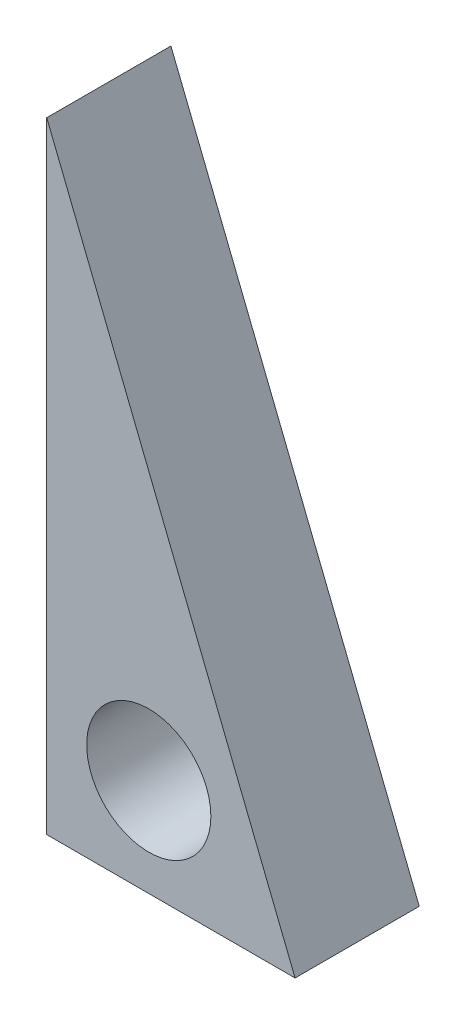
from build123d import *

# Parameters (mm, degrees)
EXTRUDE1_DEPTH = 1
SKETCH2_R      = 0.5
EXTRUDE2_DEPTH = 10


with BuildPart() as part:
    # Sketch1 → Extrude1 (new body)
    with BuildSketch(Plane.XY):
        Polygon((0, 5), (2, 0), (0, 0), align=None)
    extrude(amount=EXTRUDE1_DEPTH)

    # Sketch2 → Extrude2 (cut)
    with BuildSketch(Plane.XY.offset(1)):
        with Locations((0.821866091, 0.788224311)):
            Circle(SKETCH2_R)
    extrude(amount=-EXTRUDE2_DEPTH, mode=Mode.SUBTRACT)


solid = part.part
